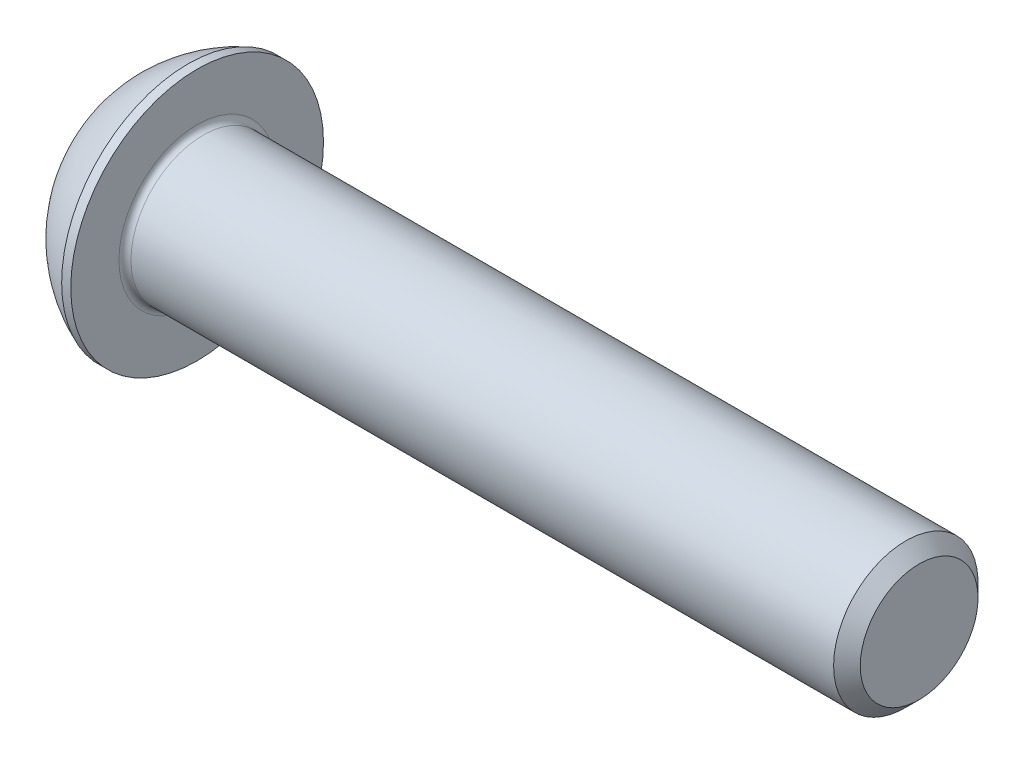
from build123d import *

# Parameters (mm, degrees)
FILLET1_R   = 0.25
HEX_2_DEPTH = 2.08


with BuildPart() as part:
    # BodySke → BaseBody (revolve)
    with BuildSketch(Plane.XY, mode=Mode.PRIVATE) as basebody_sk:
        with BuildLine():
            Line((33.3, 0), (33.3, 2.4455))
            Line((33.3, 2.4455), (32.7455, 3))
            Line((32.7455, 3), (3.3, 3))
            Line((3.3, 3), (3.3, 5.25))
            Line((3.3, 5.25), (2.92, 5.25))
            ThreePointArc((2.92, 5.25), (1.224500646, 4.199464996), (0, 2.625))
            Line((0, 2.625), (0, 0))
            Line((0, 0), (33.3, 0))
        make_face()
    revolve(basebody_sk.sketch.rotate(Axis((0, 0, 0), (1, 0, 0)), 90), axis=Axis((0, 0, 0), (1, 0, 0)))

    # Fillet1
    fillet1_edges = [part.edges().sort_by_distance(p)[0] for p in [
        (3.3, 0, -3),
    ]]
    fillet(fillet1_edges, radius=FILLET1_R)

    # Sketch2 → PreBroach (revolve, cut)
    with BuildSketch(Plane.XY, mode=Mode.PRIVATE) as prebroach_sk:
        Polygon((0, 2), (2.08, 2), (3.234700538, 0), (0, 0), align=None)
    revolve(prebroach_sk.sketch.rotate(Axis((0, 0, 0), (1, 0, 0)), 90), axis=Axis((0, 0, 0), (1, 0, 0)), mode=Mode.SUBTRACT)

    # Sketch3 → Hex 2 (cut)
    with BuildSketch(Plane(origin=(0, 0, 0), x_dir=(0, 0, -1), z_dir=(1, 0, 0))):
        Polygon((-2, -1.154700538), (-2, 1.154700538), (0, 2.309401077), (2, 1.154700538), (2, -1.154700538), (0, -2.309401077), align=None)
    extrude(amount=HEX_2_DEPTH, mode=Mode.SUBTRACT)


solid = part.part
